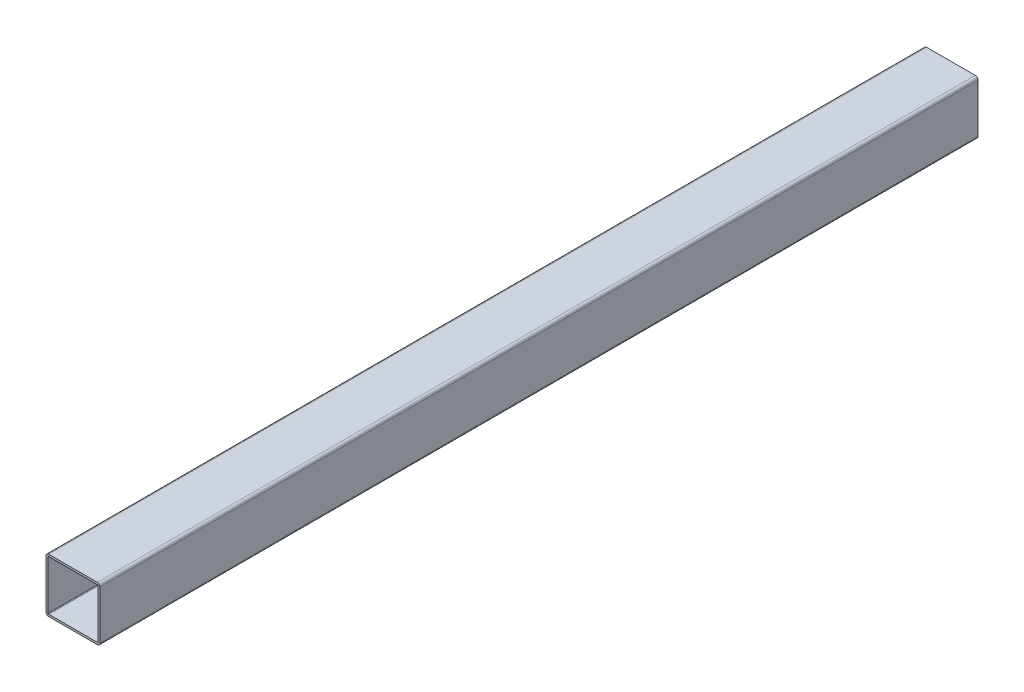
from build123d import *

# Parameters (mm, degrees)
BASE_EXTRUSION_DEPTH = 1300


with BuildPart() as part:
    # Esquisse1 → Base-Extrusion (new body)
    with BuildSketch(Plane.XY):
        with BuildLine():
            Line((4, 0), (76, 0))
            ThreePointArc((76, 0), (78.828427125, -1.171572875), (80, -4))
            Line((80, -4), (80, -76))
            ThreePointArc((80, -76), (78.828427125, -78.828427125), (76, -80))
            Line((76, -80), (4, -80))
            ThreePointArc((4, -80), (1.171572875, -78.828427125), (0, -76))
            Line((0, -76), (0, -4))
            ThreePointArc((0, -4), (1.171572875, -1.171572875), (4, 0))
        make_face()
        with BuildLine():
            Line((4, -3), (76, -3))
            ThreePointArc((76, -3), (76.707106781, -3.292893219), (77, -4))
            Line((77, -4), (77, -76))
            ThreePointArc((77, -76), (76.707106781, -76.707106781), (76, -77))
            Line((76, -77), (4, -77))
            ThreePointArc((4, -77), (3.292893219, -76.707106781), (3, -76))
            Line((3, -76), (3, -4))
            ThreePointArc((3, -4), (3.292893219, -3.292893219), (4, -3))
        make_face(mode=Mode.SUBTRACT)
    extrude(amount=BASE_EXTRUSION_DEPTH)


solid = part.part
